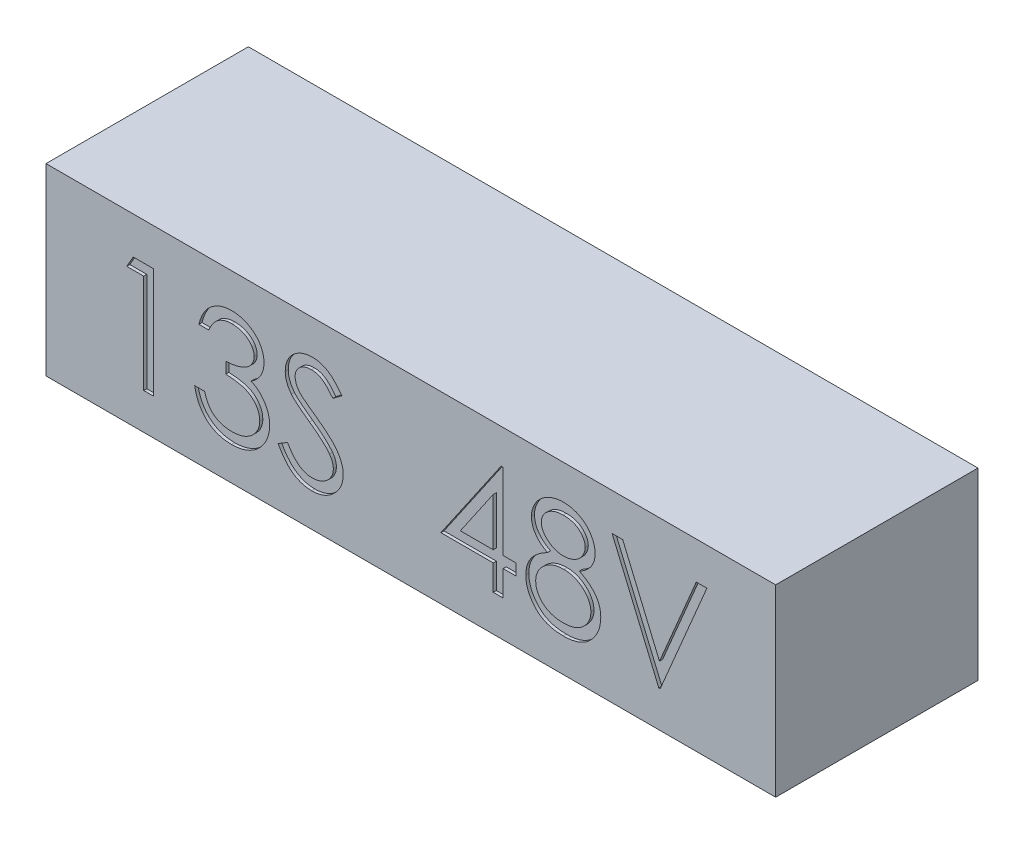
from build123d import *

# Parameters (mm, degrees)
ESQUISSE1_W             = 238
ESQUISSE1_H             = 60
BOSS_EXTRU_1_DEPTH      = 33
ENL_V_MAT_EXTRU_1_DEPTH = 1


with BuildPart() as part:
    # Esquisse1 → Boss.-Extru.1 (new, symmetric)
    with BuildSketch(Plane.XY):
        Rectangle(ESQUISSE1_W, ESQUISSE1_H)
    extrude(amount=BOSS_EXTRU_1_DEPTH, both=True)

    # Esquisse2 → Enl_v. mat.-Extru.1 (cut)
    # profile 1 of 6: a face of its own
    with BuildSketch(Plane.XY.offset(33)):
        Polygon((-90.547454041, 17.837984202), (-83.891204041, 17.837984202), (-83.891204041, -18.162015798), (-87.121973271, -18.162015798), (-87.121973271, 14.14567651), (-92.66043481, 14.14567651), align=None)
    # profile 2 of 6: a face of its own
    with BuildSketch(Plane.XY.offset(33)):
        with BuildLine():
            Line((-65.891204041, 9.530291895), (-69.121973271, 9.530291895))
            add(Edge.make_bspline(
                [(-69.121973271, 9.530291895), (-69.034446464, 9.892683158), (-68.863338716, 10.601128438), (-68.506449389, 11.613317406), (-68.117657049, 12.571159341), (-67.650797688, 13.456718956), (-67.141564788, 14.287793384), (-66.55813108, 15.04553295), (-65.927413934, 15.749209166), (-65.229785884, 16.373688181), (-64.498176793, 16.939173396), (-63.722277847, 17.421316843), (-62.917699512, 17.836079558), (-62.078867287, 18.177773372), (-61.203283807, 18.435178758), (-60.298864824, 18.621934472), (-59.363240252, 18.743214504), (-58.728122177, 18.755050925), (-58.405627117, 18.761061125)],
                knots=[0, 0, 0, 0, 1.162005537, 2.271625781, 3.343758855, 4.383309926, 5.390229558, 6.379919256, 7.361854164, 8.333198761, 9.295911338, 10.242430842, 11.177959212, 12.116337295, 13.062827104, 14.020064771, 14.994644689, 16, 16, 16, 16], degree=3))
            add(Edge.make_bspline(
                [(-58.405627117, 18.761061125), (-57.935747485, 18.746874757), (-57.006237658, 18.718811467), (-55.640674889, 18.462548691), (-54.323827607, 18.057033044), (-53.070109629, 17.496731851), (-51.90557718, 16.805662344), (-50.869433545, 15.983167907), (-49.975723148, 15.045117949), (-49.225952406, 14.009011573), (-48.638895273, 12.901697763), (-48.20600686, 11.762039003), (-47.94246957, 10.592738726), (-47.908315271, 9.803235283), (-47.891204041, 9.407695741)],
                knots=[0, 0, 0, 0, 1.083050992, 2.142477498, 3.193116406, 4.255571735, 5.30263384, 6.308962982, 7.297363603, 8.282367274, 9.249857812, 10.179914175, 11.08814088, 12, 12, 12, 12], degree=3))
            add(Edge.make_bspline(
                [(-47.891204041, 9.407695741), (-47.903172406, 9.027054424), (-47.926592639, 8.282198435), (-48.12545361, 7.194777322), (-48.460112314, 6.16989229), (-48.923687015, 5.203228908), (-49.523771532, 4.30091627), (-50.2506907, 3.46092425), (-51.109575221, 2.679527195), (-51.760444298, 2.23189833), (-52.095530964, 2.001445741)],
                knots=[0, 0, 0, 0, 1.024540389, 2.004866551, 2.965041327, 3.920577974, 4.882998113, 5.874504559, 6.905732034, 8, 8, 8, 8], degree=3))
            add(Edge.make_bspline(
                [(-52.095530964, 2.001445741), (-51.712575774, 1.816527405), (-50.953830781, 1.450150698), (-49.919596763, 0.731634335), (-48.980738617, -0.097973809), (-48.457157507, -0.745383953), (-48.194088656, -1.070669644)],
                knots=[0, 0, 0, 0, 1.015518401, 2.012035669, 3.001164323, 4, 4, 4, 4], degree=3))
            add(Edge.make_bspline(
                [(-48.194088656, -1.070669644), (-48.02086342, -1.307835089), (-47.677249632, -1.778282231), (-47.253112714, -2.534656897), (-46.868333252, -3.299415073), (-46.568502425, -4.093054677), (-46.33631408, -4.906377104), (-46.170343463, -5.740778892), (-46.067238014, -6.596941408), (-46.052472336, -7.176155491), (-46.045050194, -7.467304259)],
                knots=[0, 0, 0, 0, 1.025084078, 2.033381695, 3.024893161, 4.013698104, 4.991890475, 5.976764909, 6.982997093, 8, 8, 8, 8], degree=3))
            add(Edge.make_bspline(
                [(-46.045050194, -7.467304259), (-46.063508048, -7.971404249), (-46.100336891, -8.977231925), (-46.429521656, -10.463257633), (-46.939829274, -11.915862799), (-47.664529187, -13.305204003), (-48.547737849, -14.605116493), (-49.598498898, -15.7681871), (-50.804873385, -16.767944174), (-52.150302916, -17.603249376), (-53.607964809, -18.270976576), (-55.167028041, -18.73442456), (-56.805028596, -19.036269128), (-57.928303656, -19.068636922), (-58.499377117, -19.085092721)],
                knots=[0, 0, 0, 0, 0.955779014, 1.907060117, 2.875433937, 3.871313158, 4.872415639, 5.851225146, 6.836215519, 7.83643374, 8.849228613, 9.86973379, 10.916971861, 12, 12, 12, 12], degree=3))
            add(Edge.make_bspline(
                [(-58.499377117, -19.085092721), (-58.884261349, -19.076162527), (-59.641585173, -19.058590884), (-60.75494687, -18.938468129), (-61.817684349, -18.71907379), (-62.831234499, -18.423839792), (-63.79649773, -18.04952473), (-64.710528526, -17.58338955), (-65.578950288, -17.035042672), (-66.393568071, -16.398011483), (-67.154284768, -15.685403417), (-67.840884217, -14.884567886), (-68.464813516, -14.010308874), (-69.009366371, -13.052471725), (-69.499346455, -12.023434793), (-69.902350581, -10.910021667), (-70.257059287, -9.722186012), (-70.421974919, -8.89441497), (-70.506588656, -8.469708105)],
                knots=[0, 0, 0, 0, 1.048658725, 2.063410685, 3.046034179, 4.001477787, 4.936774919, 5.862367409, 6.792675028, 7.730719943, 8.675894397, 9.627829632, 10.600096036, 11.597688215, 12.626045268, 13.701542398, 14.82072376, 16, 16, 16, 16], degree=3))
            Line((-70.506588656, -8.469708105), (-67.275819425, -8.469708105))
            add(Edge.make_bspline(
                [(-67.275819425, -8.469708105), (-67.191648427, -8.746897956), (-67.027928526, -9.286056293), (-66.749244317, -10.062013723), (-66.43174209, -10.773353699), (-66.091135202, -11.425294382), (-65.733414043, -12.024256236), (-65.333146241, -12.554401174), (-64.919977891, -13.039014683), (-64.608533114, -13.312044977), (-64.456107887, -13.445669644)],
                knots=[0, 0, 0, 0, 1.198163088, 2.33053128, 3.407730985, 4.417276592, 5.372219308, 6.28897303, 7.162600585, 8, 8, 8, 8], degree=3))
            add(Edge.make_bspline(
                [(-64.456107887, -13.445669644), (-64.2545431, -13.60106965), (-63.85203571, -13.911389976), (-63.196133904, -14.307406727), (-62.506323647, -14.650548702), (-61.767658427, -14.912666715), (-60.996077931, -15.134608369), (-60.179110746, -15.279847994), (-59.323964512, -15.379497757), (-58.740067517, -15.388291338), (-58.44168481, -15.392785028)],
                knots=[0, 0, 0, 0, 0.946170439, 1.889420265, 2.845303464, 3.807233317, 4.801018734, 5.828864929, 6.890507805, 8, 8, 8, 8], degree=3))
            add(Edge.make_bspline(
                [(-58.44168481, -15.392785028), (-58.10479164, -15.386450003), (-57.446026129, -15.374062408), (-56.484776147, -15.260140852), (-55.570299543, -15.094228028), (-54.71274945, -14.837980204), (-53.900892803, -14.521377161), (-53.146110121, -14.123850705), (-52.438493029, -13.657447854), (-51.787104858, -13.127330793), (-51.201379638, -12.546995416), (-50.685658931, -11.940003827), (-50.247233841, -11.308915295), (-49.89357418, -10.65023748), (-49.614311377, -9.966697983), (-49.424198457, -9.256378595), (-49.292011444, -8.525092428), (-49.28124629, -8.027994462), (-49.275819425, -7.777400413)],
                knots=[0, 0, 0, 0, 1.217147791, 2.380027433, 3.494444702, 4.572153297, 5.609568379, 6.639424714, 7.649109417, 8.668170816, 9.669597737, 10.625200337, 11.543417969, 12.441394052, 13.322311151, 14.205496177, 15.095365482, 16, 16, 16, 16], degree=3))
            add(Edge.make_bspline(
                [(-49.275819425, -7.777400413), (-49.291559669, -7.441969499), (-49.322961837, -6.772776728), (-49.562707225, -5.788253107), (-49.957049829, -4.839669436), (-50.509109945, -3.943209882), (-51.181134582, -3.112372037), (-51.966602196, -2.37106536), (-52.872035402, -1.759372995), (-53.705382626, -1.336746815), (-54.443538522, -1.04836547), (-55.075239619, -0.856280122), (-55.782450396, -0.693625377), (-56.556618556, -0.542299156), (-57.403577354, -0.413508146), (-58.322404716, -0.306106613), (-59.313286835, -0.220169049), (-59.999253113, -0.181792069), (-60.352742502, -0.162015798)],
                knots=[0, 0, 0, 0, 1.07054697, 2.135767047, 3.216561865, 4.33974944, 5.486079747, 6.621378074, 7.775625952, 8.963672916, 9.598146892, 10.304877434, 11.070270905, 11.915000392, 12.823868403, 13.805723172, 14.86925407, 16, 16, 16, 16], degree=3))
            Line((-60.352742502, -0.162015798), (-60.352742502, 3.530291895))
            add(Edge.make_bspline(
                [(-60.352742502, 3.530291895), (-59.907359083, 3.537849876), (-59.034962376, 3.552654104), (-57.760620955, 3.731707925), (-56.542038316, 3.979394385), (-55.406220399, 4.358784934), (-54.37097649, 4.799427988), (-53.472832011, 5.312193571), (-52.724369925, 5.882173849), (-52.129227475, 6.518166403), (-51.681498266, 7.200264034), (-51.354136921, 7.911178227), (-51.160762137, 8.657139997), (-51.13494842, 9.16622801), (-51.121973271, 9.422118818)],
                knots=[0, 0, 0, 0, 1.321986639, 2.589447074, 3.816329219, 5.01088745, 6.139805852, 7.153945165, 8.075214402, 8.924034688, 9.728124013, 10.488707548, 11.240355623, 12, 12, 12, 12], degree=3))
            add(Edge.make_bspline(
                [(-51.121973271, 9.422118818), (-51.126235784, 9.610118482), (-51.134715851, 9.984134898), (-51.24165928, 10.530564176), (-51.402363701, 11.060288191), (-51.62329806, 11.571054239), (-51.919014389, 12.059319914), (-52.272904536, 12.52924796), (-52.694290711, 12.978155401), (-53.177158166, 13.396581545), (-53.695679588, 13.795350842), (-54.263962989, 14.133891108), (-54.8648737, 14.423383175), (-55.499077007, 14.662109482), (-56.168631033, 14.841690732), (-56.870389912, 14.970630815), (-57.6056918, 15.051246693), (-58.1073439, 15.062853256), (-58.362357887, 15.068753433)],
                knots=[0, 0, 0, 0, 0.884392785, 1.759457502, 2.611959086, 3.489218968, 4.37281399, 5.2945488, 6.255912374, 7.266815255, 8.301784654, 9.332968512, 10.37626691, 11.440494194, 12.520033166, 13.637162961, 14.798855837, 16, 16, 16, 16], degree=3))
            add(Edge.make_bspline(
                [(-58.362357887, 15.068753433), (-58.772260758, 15.054442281), (-59.5728964, 15.026489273), (-60.727106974, 14.781658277), (-61.800105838, 14.391026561), (-62.62027498, 13.924744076), (-63.225924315, 13.464453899), (-63.658715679, 13.062463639), (-64.083726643, 12.615726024), (-64.472996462, 12.096725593), (-64.866671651, 11.540610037), (-65.225072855, 10.919109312), (-65.573343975, 10.248435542), (-65.783198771, 9.774309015), (-65.891204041, 9.530291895)],
                knots=[0, 0, 0, 0, 1.472543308, 2.876219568, 4.221790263, 5.565193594, 6.249813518, 6.953379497, 7.687249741, 8.463570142, 9.283606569, 10.136032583, 11.040678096, 12, 12, 12, 12], degree=3))
        make_face()
    # profile 3 of 6: a face of its own
    with BuildSketch(Plane.XY.offset(33)):
        with BuildLine():
            Line((-43.275819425, -11.217304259), (-40.232550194, -9.392785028))
            add(Edge.make_bspline(
                [(-40.232550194, -9.392785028), (-39.949505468, -9.866590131), (-39.407202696, -10.774382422), (-38.502560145, -12.001036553), (-37.565193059, -13.043618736), (-36.588159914, -13.896063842), (-35.577424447, -14.567195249), (-34.526388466, -15.042418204), (-33.438593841, -15.338811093), (-32.698291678, -15.374811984), (-32.328704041, -15.392785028)],
                knots=[0, 0, 0, 0, 1.272034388, 2.437168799, 3.508375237, 4.49857839, 5.41946034, 6.295179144, 7.148887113, 8, 8, 8, 8], degree=3))
            add(Edge.make_bspline(
                [(-32.328704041, -15.392785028), (-32.013067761, -15.383994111), (-31.387318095, -15.366566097), (-30.466106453, -15.199106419), (-29.571436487, -14.941838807), (-28.721747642, -14.57339494), (-27.928764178, -14.127627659), (-27.233381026, -13.589209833), (-26.632221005, -12.986403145), (-26.140470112, -12.31389584), (-25.763189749, -11.590633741), (-25.473214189, -10.848252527), (-25.312293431, -10.07509011), (-25.288052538, -9.554525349), (-25.275819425, -9.29182349)],
                knots=[0, 0, 0, 0, 1.095163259, 2.171163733, 3.241058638, 4.321873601, 5.38011039, 6.391990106, 7.366004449, 8.327778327, 9.272591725, 10.192022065, 11.087607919, 12, 12, 12, 12], degree=3))
            add(Edge.make_bspline(
                [(-25.275819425, -9.29182349), (-25.290983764, -8.992089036), (-25.321810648, -8.38277269), (-25.582363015, -7.483804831), (-25.992240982, -6.594166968), (-26.370371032, -6.043868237), (-26.56668481, -5.758169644)],
                knots=[0, 0, 0, 0, 0.938893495, 1.908633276, 2.914225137, 4, 4, 4, 4], degree=3))
            add(Edge.make_bspline(
                [(-26.56668481, -5.758169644), (-26.72786827, -5.551973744), (-27.066252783, -5.119091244), (-27.647987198, -4.474740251), (-28.330610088, -3.810093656), (-29.090760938, -3.099771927), (-29.956129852, -2.376811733), (-30.899612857, -1.606738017), (-31.945298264, -0.818836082), (-32.678664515, -0.29043255), (-33.057069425, -0.017785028)],
                knots=[0, 0, 0, 0, 0.722233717, 1.516239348, 2.393582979, 3.351407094, 4.387010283, 5.505090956, 6.712668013, 8, 8, 8, 8], degree=3))
            add(Edge.make_bspline(
                [(-33.057069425, -0.017785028), (-33.435830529, 0.25199473), (-34.159992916, 0.767793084), (-35.172709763, 1.533300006), (-36.078309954, 2.233179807), (-36.87276841, 2.874021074), (-37.555735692, 3.455910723), (-38.132593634, 3.973260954), (-38.588647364, 4.440063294), (-38.842247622, 4.742888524), (-38.956107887, 4.878849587)],
                knots=[0, 0, 0, 0, 1.452282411, 2.77665338, 3.964542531, 5.026858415, 5.96415736, 6.766646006, 7.446254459, 8, 8, 8, 8], degree=3))
            add(Edge.make_bspline(
                [(-38.956107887, 4.878849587), (-39.115254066, 5.090745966), (-39.428236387, 5.507468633), (-39.841372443, 6.158810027), (-40.192518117, 6.825563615), (-40.467787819, 7.509521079), (-40.699588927, 8.201080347), (-40.855499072, 8.909264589), (-40.953124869, 9.630896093), (-40.963122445, 10.116520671), (-40.968127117, 10.359618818)],
                knots=[0, 0, 0, 0, 1.068054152, 2.10047183, 3.106115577, 4.101338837, 5.06977816, 6.043150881, 7.020423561, 8, 8, 8, 8], degree=3))
            add(Edge.make_bspline(
                [(-40.968127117, 10.359618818), (-40.954702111, 10.740496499), (-40.928139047, 11.494110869), (-40.703493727, 12.59499941), (-40.348915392, 13.646059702), (-39.852167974, 14.636885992), (-39.21180663, 15.541678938), (-38.470762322, 16.370846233), (-37.588129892, 17.067894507), (-36.61970291, 17.676932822), (-35.559694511, 18.153633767), (-34.448930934, 18.51323242), (-33.285646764, 18.716984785), (-32.497728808, 18.746224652), (-32.09793481, 18.761061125)],
                knots=[0, 0, 0, 0, 1.005424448, 1.989358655, 2.955360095, 3.929531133, 4.905563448, 5.876582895, 6.856512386, 7.866279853, 8.892233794, 9.918561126, 10.94386622, 12, 12, 12, 12], degree=3))
            add(Edge.make_bspline(
                [(-32.09793481, 18.761061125), (-31.673709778, 18.746429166), (-30.830061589, 18.717330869), (-29.589098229, 18.46432769), (-28.394302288, 18.045692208), (-27.433171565, 17.570608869), (-26.680948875, 17.096114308), (-26.107286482, 16.663910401), (-25.525964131, 16.166337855), (-24.93229271, 15.602071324), (-24.336331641, 14.965933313), (-23.729233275, 14.262280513), (-23.109577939, 13.495413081), (-22.710946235, 12.947961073), (-22.506588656, 12.667311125)],
                knots=[0, 0, 0, 0, 1.286793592, 2.559021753, 3.825965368, 5.121522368, 5.803751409, 6.523245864, 7.299691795, 8.125521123, 9.008227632, 9.944561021, 10.946284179, 12, 12, 12, 12], degree=3))
            Line((-22.506588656, 12.667311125), (-25.427261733, 10.453368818))
            add(Edge.make_bspline(
                [(-25.427261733, 10.453368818), (-25.603619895, 10.680566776), (-25.943244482, 11.118096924), (-26.458862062, 11.730830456), (-26.944848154, 12.290542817), (-27.423652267, 12.776698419), (-27.869986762, 13.215920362), (-28.303190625, 13.591963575), (-28.717029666, 13.908512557), (-29.238689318, 14.246332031), (-29.894071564, 14.581198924), (-30.716769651, 14.86456087), (-31.576514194, 15.034841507), (-32.162076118, 15.057355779), (-32.458511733, 15.068753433)],
                knots=[0, 0, 0, 0, 1.181633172, 2.275549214, 3.290209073, 4.226197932, 5.078386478, 5.862611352, 6.581680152, 7.217281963, 8.414376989, 9.595101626, 10.782541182, 12, 12, 12, 12], degree=3))
            add(Edge.make_bspline(
                [(-32.458511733, 15.068753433), (-32.830407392, 15.056290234), (-33.547573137, 15.032256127), (-34.565758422, 14.76976485), (-35.48215308, 14.356465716), (-36.269550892, 13.777225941), (-36.925131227, 13.090952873), (-37.399358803, 12.301227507), (-37.684789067, 11.429179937), (-37.719619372, 10.820865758), (-37.737357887, 10.511061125)],
                knots=[0, 0, 0, 0, 1.14458467, 2.207223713, 3.21896685, 4.227309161, 5.202851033, 6.127160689, 7.046193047, 8, 8, 8, 8], degree=3))
            add(Edge.make_bspline(
                [(-37.737357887, 10.511061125), (-37.733314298, 10.318188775), (-37.72522051, 9.932128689), (-37.612336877, 9.361771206), (-37.467315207, 8.792854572), (-37.237505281, 8.227936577), (-36.920239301, 7.657137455), (-36.503614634, 7.070628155), (-35.978906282, 6.463239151), (-35.576971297, 6.068191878), (-35.364761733, 5.859618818)],
                knots=[0, 0, 0, 0, 0.858281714, 1.717966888, 2.583508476, 3.4729293, 4.427298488, 5.488583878, 6.674047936, 8, 8, 8, 8], degree=3))
            add(Edge.make_bspline(
                [(-35.364761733, 5.859618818), (-35.285959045, 5.789295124), (-35.098741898, 5.622222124), (-34.756475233, 5.348701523), (-34.304492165, 5.011301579), (-33.754595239, 4.593832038), (-33.096645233, 4.109565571), (-32.330569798, 3.564694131), (-31.464908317, 2.94152941), (-30.850625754, 2.50585185), (-30.525819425, 2.275484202)],
                knots=[0, 0, 0, 0, 0.420754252, 0.999615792, 1.744751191, 2.668019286, 3.750313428, 4.999500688, 6.413464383, 8, 8, 8, 8], degree=3))
            add(Edge.make_bspline(
                [(-30.525819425, 2.275484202), (-30.135107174, 1.991173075), (-29.378547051, 1.440643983), (-28.302069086, 0.613511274), (-27.326018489, -0.195437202), (-26.446968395, -0.981035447), (-25.65623448, -1.737324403), (-24.962589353, -2.47340283), (-24.358965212, -3.183997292), (-23.709121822, -4.095029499), (-23.045098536, -5.213920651), (-22.474843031, -6.584782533), (-22.115271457, -7.960973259), (-22.068250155, -8.885935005), (-22.045050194, -9.342304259)],
                knots=[0, 0, 0, 0, 1.163667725, 2.253281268, 3.268753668, 4.215851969, 5.092017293, 5.902905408, 6.650798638, 7.335211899, 8.59617414, 9.77448103, 10.901945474, 12, 12, 12, 12], degree=3))
            add(Edge.make_bspline(
                [(-22.045050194, -9.342304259), (-22.051809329, -9.665053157), (-22.065196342, -10.304283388), (-22.219080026, -11.242907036), (-22.444539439, -12.154538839), (-22.784350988, -13.027910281), (-23.199103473, -13.878999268), (-23.72538488, -14.68548053), (-24.33540678, -15.465203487), (-25.035182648, -16.197376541), (-25.800911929, -16.869508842), (-26.610229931, -17.46740776), (-27.46446131, -17.965939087), (-28.358971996, -18.372747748), (-29.293967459, -18.690921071), (-30.269133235, -18.921453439), (-31.286076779, -19.062940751), (-31.977281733, -19.077626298), (-32.328704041, -19.085092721)],
                knots=[0, 0, 0, 0, 0.983748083, 1.948392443, 2.894712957, 3.844097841, 4.80183111, 5.778335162, 6.776009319, 7.81870978, 8.863265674, 9.881300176, 10.883814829, 11.87499822, 12.874611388, 13.892143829, 14.928324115, 16, 16, 16, 16], degree=3))
            add(Edge.make_bspline(
                [(-32.328704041, -19.085092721), (-32.600610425, -19.079834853), (-33.140998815, -19.069385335), (-33.940296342, -18.97700645), (-34.723446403, -18.846304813), (-35.480621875, -18.638800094), (-36.221578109, -18.387036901), (-36.943092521, -18.077042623), (-37.64551479, -17.705551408), (-38.332781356, -17.280802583), (-39.003144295, -16.786494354), (-39.650315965, -16.210766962), (-40.295530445, -15.56949891), (-40.919743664, -14.845275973), (-41.53558172, -14.049798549), (-42.130902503, -13.175624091), (-42.718028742, -12.227514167), (-43.086416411, -11.560330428), (-43.275819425, -11.217304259)],
                knots=[0, 0, 0, 0, 0.915332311, 1.819136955, 2.706846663, 3.586547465, 4.459518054, 5.340707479, 6.227863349, 7.133153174, 8.059268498, 9.028702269, 10.047606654, 11.120612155, 12.245963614, 13.433783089, 14.680604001, 16, 16, 16, 16], degree=3))
        make_face()
    # profile 4 of 6: a face of its own
    with BuildSketch(Plane.XY.offset(33)):
        Polygon((29.452545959, 18.761061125), (30.108795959, 18.761061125), (30.108795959, -6.162015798), (34.262642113, -6.162015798), (34.262642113, -9.85432349), (30.108795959, -9.85432349), (30.108795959, -18.162015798), (26.878026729, -18.162015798), (26.878026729, -9.85432349), (9.801103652, -9.85432349), align=None)
        Polygon((26.878026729, -6.162015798), (26.878026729, 9.472599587), (16.147257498, -6.162015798), align=None, mode=Mode.SUBTRACT)
    # profile 5 of 6: a face of its own
    with BuildSketch(Plane.XY.offset(33)):
        with BuildLine():
            add(Edge.make_bspline(
                [(54.99581519, 1.893272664), (55.290485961, 1.739625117), (55.865192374, 1.439961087), (56.683700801, 0.957449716), (57.431729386, 0.448914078), (58.130032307, -0.06162619), (58.766341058, -0.593723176), (59.333540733, -1.149492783), (59.845641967, -1.715062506), (60.292317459, -2.300009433), (60.685199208, -2.902779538), (61.024752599, -3.524954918), (61.314986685, -4.165172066), (61.545005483, -4.830419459), (61.734486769, -5.510925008), (61.864864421, -6.215475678), (61.93498129, -6.939428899), (61.948237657, -7.428702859), (61.954949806, -7.676438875)],
                knots=[0, 0, 0, 0, 1.272397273, 2.481599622, 3.635517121, 4.734568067, 5.792894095, 6.808321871, 7.773003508, 8.711915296, 9.623354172, 10.525449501, 11.423591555, 12.311487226, 13.218079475, 14.126165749, 15.051214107, 16, 16, 16, 16], degree=3))
            add(Edge.make_bspline(
                [(61.954949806, -7.676438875), (61.947015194, -8.023044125), (61.931309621, -8.709105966), (61.794509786, -9.721694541), (61.589690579, -10.705130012), (61.290587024, -11.659196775), (60.902677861, -12.57863033), (60.424630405, -13.464217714), (59.88348658, -14.330473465), (59.44889212, -14.863473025), (59.228988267, -15.133169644)],
                knots=[0, 0, 0, 0, 1.025265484, 2.029385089, 3.018602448, 3.995076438, 4.983346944, 5.966715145, 6.97116228, 8, 8, 8, 8], degree=3))
            add(Edge.make_bspline(
                [(59.228988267, -15.133169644), (58.942670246, -15.447848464), (58.373572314, -16.073317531), (57.398662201, -16.885383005), (56.328722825, -17.567833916), (55.167894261, -18.124001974), (53.919279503, -18.556885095), (52.583144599, -18.867950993), (51.15688474, -19.046124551), (50.176599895, -19.071879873), (49.673699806, -19.085092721)],
                knots=[0, 0, 0, 0, 0.954267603, 1.896743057, 2.838368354, 3.796610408, 4.779680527, 5.799409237, 6.871065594, 8, 8, 8, 8], degree=3))
            add(Edge.make_bspline(
                [(49.673699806, -19.085092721), (49.190133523, -19.073238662), (48.249162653, -19.050171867), (46.87953877, -18.893886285), (45.602844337, -18.619999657), (44.411656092, -18.245140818), (43.313155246, -17.757492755), (42.31047192, -17.150549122), (41.389139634, -16.448740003), (40.577118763, -15.631909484), (39.856209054, -14.757028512), (39.222937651, -13.854440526), (38.696575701, -12.924063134), (38.250925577, -11.979769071), (37.909768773, -11.008322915), (37.673483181, -10.01472278), (37.523421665, -9.000704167), (37.503455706, -8.316378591), (37.493411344, -7.972111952)],
                knots=[0, 0, 0, 0, 1.256902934, 2.445805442, 3.576955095, 4.645999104, 5.686449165, 6.692658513, 7.68621702, 8.689161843, 9.678783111, 10.630372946, 11.551080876, 12.453998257, 13.34127905, 14.221779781, 15.105423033, 16, 16, 16, 16], degree=3))
            add(Edge.make_bspline(
                [(37.493411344, -7.972111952), (37.499355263, -7.719503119), (37.511102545, -7.220258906), (37.592409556, -6.482677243), (37.723125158, -5.764774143), (37.900650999, -5.063897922), (38.141244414, -4.385151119), (38.431734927, -3.725317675), (38.770463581, -3.083652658), (39.162155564, -2.456647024), (39.617833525, -1.853086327), (40.133802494, -1.262727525), (40.720374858, -0.694731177), (41.371025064, -0.142157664), (42.07831747, 0.40479521), (42.860623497, 0.916568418), (43.697204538, 1.429393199), (44.291774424, 1.735993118), (44.596776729, 1.893272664)],
                knots=[0, 0, 0, 0, 0.941657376, 1.861047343, 2.762797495, 3.66048619, 4.553285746, 5.444104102, 6.34607688, 7.256116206, 8.197091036, 9.162375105, 10.176350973, 11.237807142, 12.343728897, 13.50695164, 14.721116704, 16, 16, 16, 16], degree=3))
            add(Edge.make_bspline(
                [(44.596776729, 1.893272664), (44.179265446, 2.12094457), (43.370846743, 2.561781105), (42.300418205, 3.371748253), (41.380971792, 4.248994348), (40.637780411, 5.212043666), (40.052808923, 6.230811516), (39.651474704, 7.298923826), (39.379968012, 8.39657528), (39.353072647, 9.146467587), (39.33956519, 9.523080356)],
                knots=[0, 0, 0, 0, 1.166880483, 2.259407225, 3.286803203, 4.280235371, 5.237608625, 6.161067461, 7.076446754, 8, 8, 8, 8], degree=3))
            add(Edge.make_bspline(
                [(39.33956519, 9.523080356), (39.356386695, 9.906712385), (39.390200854, 10.677879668), (39.663629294, 11.825828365), (40.109207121, 12.953313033), (40.715251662, 14.054868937), (41.470091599, 15.093214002), (42.375713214, 16.024492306), (43.410489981, 16.840267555), (44.569256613, 17.525051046), (45.816257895, 18.082368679), (47.131962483, 18.466832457), (48.493446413, 18.718175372), (49.420165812, 18.746632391), (49.890045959, 18.761061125)],
                knots=[0, 0, 0, 0, 0.888701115, 1.786444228, 2.72001202, 3.692817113, 4.693886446, 5.687152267, 6.695133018, 7.739871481, 8.800368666, 9.853104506, 10.91144658, 12, 12, 12, 12], degree=3))
            add(Edge.make_bspline(
                [(49.890045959, 18.761061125), (50.347799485, 18.746184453), (51.250437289, 18.716849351), (52.577239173, 18.47218432), (53.846752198, 18.063537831), (55.054598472, 17.509166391), (56.179154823, 16.826329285), (57.172778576, 15.999348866), (58.050485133, 15.07217863), (58.776496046, 14.034148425), (59.374742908, 12.93682529), (59.791323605, 11.788707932), (60.058258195, 10.614603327), (60.091927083, 9.820155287), (60.108795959, 9.422118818)],
                knots=[0, 0, 0, 0, 1.072916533, 2.115669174, 3.151510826, 4.193348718, 5.225979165, 6.227137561, 7.216255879, 8.211077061, 9.189680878, 10.138522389, 11.067357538, 12, 12, 12, 12], degree=3))
            add(Edge.make_bspline(
                [(60.108795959, 9.422118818), (60.094040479, 9.031501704), (60.065061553, 8.264351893), (59.821290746, 7.146021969), (59.410753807, 6.098709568), (58.850242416, 5.110530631), (58.119694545, 4.199406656), (57.228861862, 3.353751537), (56.184846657, 2.566618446), (55.40044897, 2.122415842), (54.99581519, 1.893272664)],
                knots=[0, 0, 0, 0, 0.975232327, 1.915300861, 2.843280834, 3.77672583, 4.742871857, 5.749627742, 6.839139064, 8, 8, 8, 8], degree=3))
        make_face()
        with BuildLine():
            add(Edge.make_bspline(
                [(49.709757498, 15.068753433), (49.457234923, 15.062052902), (48.963190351, 15.048943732), (48.238781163, 14.980454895), (47.549922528, 14.847221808), (46.889417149, 14.669909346), (46.266320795, 14.430375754), (45.672171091, 14.148598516), (45.117079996, 13.806021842), (44.594346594, 13.421735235), (44.123767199, 12.999065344), (43.706120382, 12.558695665), (43.359202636, 12.091977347), (43.064608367, 11.610519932), (42.850855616, 11.100034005), (42.690765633, 10.576170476), (42.582545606, 10.032309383), (42.574436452, 9.66061956), (42.570334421, 9.472599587)],
                knots=[0, 0, 0, 0, 1.203892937, 2.355340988, 3.463153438, 4.544400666, 5.610487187, 6.640501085, 7.674077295, 8.714426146, 9.728707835, 10.68524104, 11.601827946, 12.495867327, 13.368432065, 14.231010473, 15.105153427, 16, 16, 16, 16], degree=3))
            add(Edge.make_bspline(
                [(42.570334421, 9.472599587), (42.577404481, 9.284571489), (42.591375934, 8.913000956), (42.69942868, 8.36430062), (42.860470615, 7.825106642), (43.114020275, 7.308240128), (43.418131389, 6.795771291), (43.793472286, 6.30050812), (44.240788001, 5.820727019), (44.745070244, 5.360508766), (45.294446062, 4.92955006), (45.876453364, 4.555425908), (46.483787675, 4.242389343), (47.110208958, 3.981858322), (47.76210156, 3.779333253), (48.435471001, 3.635655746), (49.130430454, 3.546355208), (49.601316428, 3.535688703), (49.83956519, 3.530291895)],
                knots=[0, 0, 0, 0, 0.873023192, 1.725219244, 2.590779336, 3.480155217, 4.391973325, 5.357036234, 6.360879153, 7.436073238, 8.526419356, 9.601555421, 10.645666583, 11.697338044, 12.750135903, 13.812665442, 14.89329948, 16, 16, 16, 16], degree=3))
            add(Edge.make_bspline(
                [(49.83956519, 3.530291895), (50.145566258, 3.539269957), (50.754546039, 3.557137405), (51.652276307, 3.723263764), (52.525149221, 3.984581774), (53.363835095, 4.342112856), (54.146625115, 4.790856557), (54.844408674, 5.328110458), (55.451233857, 5.941469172), (55.960794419, 6.621384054), (56.355867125, 7.34500039), (56.663428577, 8.071174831), (56.843029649, 8.807654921), (56.866456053, 9.301029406), (56.878026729, 9.544714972)],
                knots=[0, 0, 0, 0, 1.076279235, 2.141928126, 3.20205304, 4.278698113, 5.344010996, 6.36967002, 7.368914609, 8.37248503, 9.349703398, 10.264243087, 11.142681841, 12, 12, 12, 12], degree=3))
            add(Edge.make_bspline(
                [(56.878026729, 9.544714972), (56.872555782, 9.715746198), (56.861696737, 10.055218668), (56.772210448, 10.556527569), (56.624344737, 11.046431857), (56.424153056, 11.528978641), (56.160738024, 11.9973976), (55.848420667, 12.459052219), (55.469037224, 12.903557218), (55.043245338, 13.341271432), (54.560378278, 13.746364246), (54.021366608, 14.10260698), (53.428973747, 14.405134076), (52.78318569, 14.650846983), (52.086380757, 14.835396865), (51.341768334, 14.973599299), (50.543139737, 15.051494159), (49.993576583, 15.062875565), (49.709757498, 15.068753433)],
                knots=[0, 0, 0, 0, 0.814439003, 1.616544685, 2.417341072, 3.248991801, 4.09997495, 4.973547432, 5.9003056, 6.880240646, 7.880314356, 8.896779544, 9.951930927, 11.043077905, 12.18215768, 13.381699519, 14.647792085, 16, 16, 16, 16], degree=3))
        make_face(mode=Mode.SUBTRACT)
        with BuildLine():
            add(Edge.make_bspline(
                [(49.918892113, -0.162015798), (49.598741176, -0.167710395), (48.970683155, -0.178881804), (48.050554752, -0.303230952), (47.167493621, -0.47633328), (46.324477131, -0.73893619), (45.521861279, -1.080385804), (44.755301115, -1.491141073), (44.030660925, -1.976682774), (43.357947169, -2.530842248), (42.743650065, -3.128025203), (42.204696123, -3.760207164), (41.747007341, -4.41563893), (41.37843676, -5.102644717), (41.075916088, -5.806677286), (40.877259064, -6.545269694), (40.749904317, -7.304222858), (40.732802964, -7.820155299), (40.724180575, -8.080285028)],
                knots=[0, 0, 0, 0, 1.140299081, 2.23698856, 3.303958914, 4.344563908, 5.37730929, 6.408454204, 7.439741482, 8.480804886, 9.510774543, 10.48932336, 11.43758569, 12.353841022, 13.263987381, 14.161954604, 15.073269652, 16, 16, 16, 16], degree=3))
            add(Edge.make_bspline(
                [(40.724180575, -8.080285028), (40.738202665, -8.403574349), (40.766022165, -9.044972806), (40.986719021, -9.992935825), (41.3409131, -10.910638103), (41.83488675, -11.790601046), (42.446553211, -12.612944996), (43.198711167, -13.329743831), (44.044616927, -13.966650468), (45.012891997, -14.481764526), (46.070556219, -14.893140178), (47.217328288, -15.176572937), (48.436750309, -15.364199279), (49.278734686, -15.383106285), (49.709757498, -15.392785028)],
                knots=[0, 0, 0, 0, 0.898778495, 1.783155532, 2.693654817, 3.627872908, 4.583023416, 5.533784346, 6.509005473, 7.520592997, 8.575161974, 9.658835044, 10.801527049, 12, 12, 12, 12], degree=3))
            add(Edge.make_bspline(
                [(49.709757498, -15.392785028), (50.046618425, -15.386317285), (50.702931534, -15.373716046), (51.660387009, -15.262483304), (52.563930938, -15.086087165), (53.41181115, -14.829524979), (54.213519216, -14.51632522), (54.955462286, -14.113412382), (55.656727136, -13.655159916), (56.282758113, -13.111476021), (56.85292826, -12.530544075), (57.350070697, -11.915560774), (57.781634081, -11.283239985), (58.120352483, -10.619292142), (58.391136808, -9.936455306), (58.585779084, -9.228432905), (58.705877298, -8.493053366), (58.718023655, -7.994205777), (58.724180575, -7.741342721)],
                knots=[0, 0, 0, 0, 1.224942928, 2.386581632, 3.501229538, 4.569074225, 5.605009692, 6.626002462, 7.634866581, 8.645888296, 9.63523824, 10.59253846, 11.518950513, 12.414518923, 13.29783783, 14.186679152, 15.080837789, 16, 16, 16, 16], degree=3))
            add(Edge.make_bspline(
                [(58.724180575, -7.741342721), (58.714863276, -7.495747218), (58.696491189, -7.011475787), (58.579885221, -6.293877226), (58.375036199, -5.600591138), (58.093954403, -4.923276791), (57.719750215, -4.275657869), (57.279060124, -3.640862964), (56.747349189, -3.036510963), (56.146533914, -2.457907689), (55.491756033, -1.922888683), (54.795751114, -1.449597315), (54.063876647, -1.051004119), (53.297681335, -0.726834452), (52.498866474, -0.471877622), (51.668019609, -0.293770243), (50.804167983, -0.181660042), (50.217317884, -0.168637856), (49.918892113, -0.162015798)],
                knots=[0, 0, 0, 0, 0.917430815, 1.809013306, 2.70690318, 3.612392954, 4.541220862, 5.495268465, 6.494511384, 7.542276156, 8.608045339, 9.649016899, 10.681629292, 11.715607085, 12.752076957, 13.808767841, 14.885711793, 16, 16, 16, 16], degree=3))
        make_face(mode=Mode.SUBTRACT)
    # profile 6 of 6: a face of its own
    with BuildSketch(Plane.XY.offset(33)):
        Polygon((65.647257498, 17.837984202), (69.108795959, 17.837984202), (81.108795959, -10.532208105), (93.108795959, 17.837984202), (96.570334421, 17.837984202), (81.33956519, -18.162015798), (80.878026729, -18.162015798), align=None)
    extrude(amount=-ENL_V_MAT_EXTRU_1_DEPTH, mode=Mode.SUBTRACT)


solid = part.part
